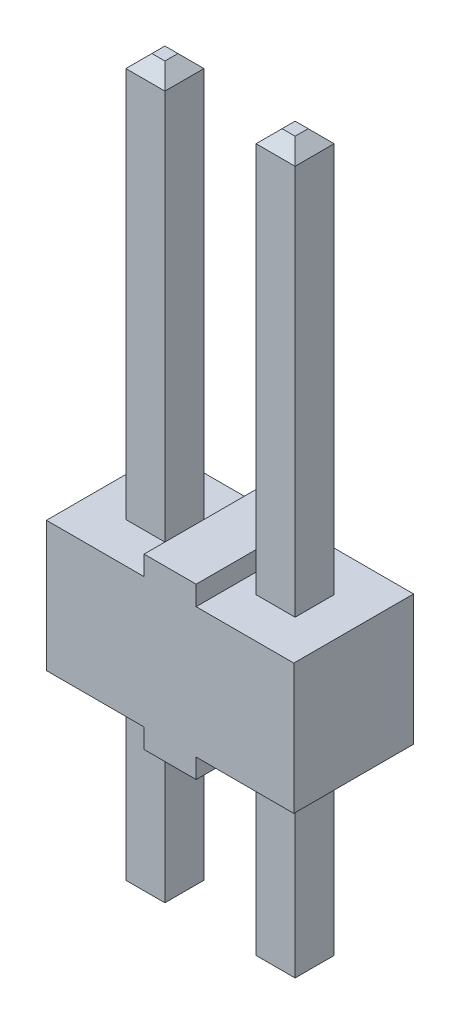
ISO-10303-21;
HEADER;
FILE_DESCRIPTION(('STEP AP214'),'2;1');
FILE_NAME('part.step','',(''),(''),'','','');
FILE_SCHEMA(('AUTOMOTIVE_DESIGN { 1 0 10303 214 1 1 1 1 }'));
ENDSEC;
DATA;
#1=APPLICATION_CONTEXT('core data for automotive mechanical design processes');
#2=APPLICATION_PROTOCOL_DEFINITION('international standard','automotive_design',2000,#1);
#3=PRODUCT_CONTEXT('',#1,'mechanical');
#4=PRODUCT('Part','Part','',(#3));
#5=PRODUCT_RELATED_PRODUCT_CATEGORY('part','',(#4));
#6=PRODUCT_DEFINITION_FORMATION('','',#4);
#7=PRODUCT_DEFINITION_CONTEXT('part definition',#1,'design');
#8=PRODUCT_DEFINITION('design','',#6,#7);
#9=PRODUCT_DEFINITION_SHAPE('','',#8);
#10=(LENGTH_UNIT() NAMED_UNIT(*) SI_UNIT(.MILLI.,.METRE.));
#11=(NAMED_UNIT(*) PLANE_ANGLE_UNIT() SI_UNIT($,.RADIAN.));
#12=(NAMED_UNIT(*) SI_UNIT($,.STERADIAN.) SOLID_ANGLE_UNIT());
#13=UNCERTAINTY_MEASURE_WITH_UNIT(LENGTH_MEASURE(1.E-05),#10,'distance_accuracy_value','');
#14=(GEOMETRIC_REPRESENTATION_CONTEXT(3) GLOBAL_UNCERTAINTY_ASSIGNED_CONTEXT((#13)) GLOBAL_UNIT_ASSIGNED_CONTEXT((#10,
#11,#12)) REPRESENTATION_CONTEXT('',''));
#15=CARTESIAN_POINT('',(0.,0.,0.));
#16=DIRECTION('',(0.,0.,1.));
#17=DIRECTION('',(1.,0.,0.));
#18=AXIS2_PLACEMENT_3D('',#15,#16,#17);
#19=CARTESIAN_POINT('',(0.889,8.89,0.381));
#20=DIRECTION('',(0.,0.707106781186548,0.707106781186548));
#21=DIRECTION('',(0.,-0.707106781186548,0.707106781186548));
#22=AXIS2_PLACEMENT_3D('',#19,#20,#21);
#23=PLANE('',#22);
#24=DIRECTION('',(1.,0.,0.));
#25=VECTOR('',#24,1.);
#26=CARTESIAN_POINT('',(0.889,9.144,0.127));
#27=LINE('',#26,#25);
#28=CARTESIAN_POINT('',(1.397,9.144,0.127));
#29=VERTEX_POINT('',#28);
#30=CARTESIAN_POINT('',(1.143,9.144,0.127));
#31=VERTEX_POINT('',#30);
#32=EDGE_CURVE('E21',#29,#31,#27,.F.);
#33=ORIENTED_EDGE('',*,*,#32,.T.);
#34=DIRECTION('',(-0.577350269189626,-0.577350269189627,0.577350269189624));
#35=VECTOR('',#34,1.);
#36=CARTESIAN_POINT('',(1.14300000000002,9.14400000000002,0.126999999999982));
#37=LINE('',#36,#35);
#38=CARTESIAN_POINT('',(0.889,8.89,0.381));
#39=VERTEX_POINT('',#38);
#40=EDGE_CURVE('E269',#31,#39,#37,.T.);
#41=ORIENTED_EDGE('',*,*,#40,.T.);
#42=DIRECTION('',(1.,0.,0.));
#43=VECTOR('',#42,1.);
#44=CARTESIAN_POINT('',(0.889,8.89,0.381));
#45=LINE('',#44,#43);
#46=CARTESIAN_POINT('',(1.651,8.89,0.381));
#47=VERTEX_POINT('',#46);
#48=EDGE_CURVE('E252',#39,#47,#45,.T.);
#49=ORIENTED_EDGE('',*,*,#48,.T.);
#50=DIRECTION('',(-0.577350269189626,0.577350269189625,-0.577350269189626));
#51=VECTOR('',#50,1.);
#52=CARTESIAN_POINT('',(1.651,8.89,0.381));
#53=LINE('',#52,#51);
#54=EDGE_CURVE('E250',#47,#29,#53,.T.);
#55=ORIENTED_EDGE('',*,*,#54,.T.);
#56=EDGE_LOOP('',(#33,#41,#49,#55));
#57=FACE_BOUND('',#56,.T.);
#58=ADVANCED_FACE('F18',(#57),#23,.T.);
#59=CARTESIAN_POINT('',(-1.651,8.89,0.381));
#60=DIRECTION('',(0.,0.707106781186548,0.707106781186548));
#61=DIRECTION('',(0.,-0.707106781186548,0.707106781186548));
#62=AXIS2_PLACEMENT_3D('',#59,#60,#61);
#63=PLANE('',#62);
#64=DIRECTION('',(1.,0.,0.));
#65=VECTOR('',#64,1.);
#66=CARTESIAN_POINT('',(-1.651,9.144,0.127));
#67=LINE('',#66,#65);
#68=CARTESIAN_POINT('',(-1.143,9.144,0.127));
#69=VERTEX_POINT('',#68);
#70=CARTESIAN_POINT('',(-1.397,9.144,0.127));
#71=VERTEX_POINT('',#70);
#72=EDGE_CURVE('E276',#69,#71,#67,.F.);
#73=ORIENTED_EDGE('',*,*,#72,.T.);
#74=DIRECTION('',(-0.577350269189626,-0.577350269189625,0.577350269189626));
#75=VECTOR('',#74,1.);
#76=CARTESIAN_POINT('',(-1.39699999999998,9.14400000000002,0.126999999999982));
#77=LINE('',#76,#75);
#78=CARTESIAN_POINT('',(-1.651,8.89,0.381));
#79=VERTEX_POINT('',#78);
#80=EDGE_CURVE('E285',#71,#79,#77,.T.);
#81=ORIENTED_EDGE('',*,*,#80,.T.);
#82=DIRECTION('',(1.,0.,0.));
#83=VECTOR('',#82,1.);
#84=CARTESIAN_POINT('',(-1.651,8.89,0.381));
#85=LINE('',#84,#83);
#86=CARTESIAN_POINT('',(-0.889,8.89,0.381));
#87=VERTEX_POINT('',#86);
#88=EDGE_CURVE('E289',#79,#87,#85,.T.);
#89=ORIENTED_EDGE('',*,*,#88,.T.);
#90=DIRECTION('',(-0.577350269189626,0.577350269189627,-0.577350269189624));
#91=VECTOR('',#90,1.);
#92=CARTESIAN_POINT('',(-0.889,8.89,0.381));
#93=LINE('',#92,#91);
#94=EDGE_CURVE('E278',#87,#69,#93,.T.);
#95=ORIENTED_EDGE('',*,*,#94,.T.);
#96=EDGE_LOOP('',(#73,#81,#89,#95));
#97=FACE_BOUND('',#96,.T.);
#98=ADVANCED_FACE('F748',(#97),#63,.T.);
#99=CARTESIAN_POINT('',(-1.651,-4.826,-0.381));
#100=DIRECTION('',(0.,-0.707106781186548,-0.707106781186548));
#101=DIRECTION('',(0.,0.707106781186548,-0.707106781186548));
#102=AXIS2_PLACEMENT_3D('',#99,#100,#101);
#103=PLANE('',#102);
#104=DIRECTION('',(1.,0.,0.));
#105=VECTOR('',#104,1.);
#106=CARTESIAN_POINT('',(-1.651,-5.08,-0.127));
#107=LINE('',#106,#105);
#108=CARTESIAN_POINT('',(-1.143,-5.08,-0.127));
#109=VERTEX_POINT('',#108);
#110=CARTESIAN_POINT('',(-1.397,-5.08,-0.127));
#111=VERTEX_POINT('',#110);
#112=EDGE_CURVE('E291',#109,#111,#107,.F.);
#113=ORIENTED_EDGE('',*,*,#112,.T.);
#114=DIRECTION('',(-0.577350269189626,0.577350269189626,-0.577350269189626));
#115=VECTOR('',#114,1.);
#116=CARTESIAN_POINT('',(-1.39699999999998,-5.08000000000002,-0.126999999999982));
#117=LINE('',#116,#115);
#118=CARTESIAN_POINT('',(-1.651,-4.826,-0.381));
#119=VERTEX_POINT('',#118);
#120=EDGE_CURVE('E300',#111,#119,#117,.T.);
#121=ORIENTED_EDGE('',*,*,#120,.T.);
#122=DIRECTION('',(-1.,0.,0.));
#123=VECTOR('',#122,1.);
#124=CARTESIAN_POINT('',(-1.651,-4.826,-0.381));
#125=LINE('',#124,#123);
#126=CARTESIAN_POINT('',(-0.889,-4.826,-0.381));
#127=VERTEX_POINT('',#126);
#128=EDGE_CURVE('E304',#119,#127,#125,.F.);
#129=ORIENTED_EDGE('',*,*,#128,.T.);
#130=DIRECTION('',(-0.577350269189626,-0.577350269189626,0.577350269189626));
#131=VECTOR('',#130,1.);
#132=CARTESIAN_POINT('',(-0.889,-4.826,-0.381));
#133=LINE('',#132,#131);
#134=EDGE_CURVE('E293',#127,#109,#133,.T.);
#135=ORIENTED_EDGE('',*,*,#134,.T.);
#136=EDGE_LOOP('',(#113,#121,#129,#135));
#137=FACE_BOUND('',#136,.T.);
#138=ADVANCED_FACE('F746',(#137),#103,.T.);
#139=CARTESIAN_POINT('',(0.889,-4.826,-0.381));
#140=DIRECTION('',(0.,-0.707106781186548,-0.707106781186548));
#141=DIRECTION('',(0.,0.707106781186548,-0.707106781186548));
#142=AXIS2_PLACEMENT_3D('',#139,#140,#141);
#143=PLANE('',#142);
#144=DIRECTION('',(1.,0.,0.));
#145=VECTOR('',#144,1.);
#146=CARTESIAN_POINT('',(0.889,-5.08,-0.127));
#147=LINE('',#146,#145);
#148=CARTESIAN_POINT('',(1.397,-5.08,-0.127));
#149=VERTEX_POINT('',#148);
#150=CARTESIAN_POINT('',(1.143,-5.08,-0.127));
#151=VERTEX_POINT('',#150);
#152=EDGE_CURVE('E306',#149,#151,#147,.F.);
#153=ORIENTED_EDGE('',*,*,#152,.T.);
#154=DIRECTION('',(-0.577350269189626,0.577350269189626,-0.577350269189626));
#155=VECTOR('',#154,1.);
#156=CARTESIAN_POINT('',(1.14300000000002,-5.08000000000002,-0.126999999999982));
#157=LINE('',#156,#155);
#158=CARTESIAN_POINT('',(0.889,-4.826,-0.381));
#159=VERTEX_POINT('',#158);
#160=EDGE_CURVE('E315',#151,#159,#157,.T.);
#161=ORIENTED_EDGE('',*,*,#160,.T.);
#162=DIRECTION('',(-1.,0.,0.));
#163=VECTOR('',#162,1.);
#164=CARTESIAN_POINT('',(0.889,-4.826,-0.381));
#165=LINE('',#164,#163);
#166=CARTESIAN_POINT('',(1.651,-4.826,-0.381));
#167=VERTEX_POINT('',#166);
#168=EDGE_CURVE('E319',#159,#167,#165,.F.);
#169=ORIENTED_EDGE('',*,*,#168,.T.);
#170=DIRECTION('',(-0.577350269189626,-0.577350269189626,0.577350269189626));
#171=VECTOR('',#170,1.);
#172=CARTESIAN_POINT('',(1.651,-4.826,-0.381));
#173=LINE('',#172,#171);
#174=EDGE_CURVE('E308',#167,#149,#173,.T.);
#175=ORIENTED_EDGE('',*,*,#174,.T.);
#176=EDGE_LOOP('',(#153,#161,#169,#175));
#177=FACE_BOUND('',#176,.T.);
#178=ADVANCED_FACE('F680',(#177),#143,.T.);
#179=CARTESIAN_POINT('',(0.889,9.144,-0.381));
#180=DIRECTION('',(0.,1.,0.));
#181=DIRECTION('',(0.,0.,1.));
#182=AXIS2_PLACEMENT_3D('',#179,#180,#181);
#183=PLANE('',#182);
#184=DIRECTION('',(0.,0.,1.));
#185=VECTOR('',#184,1.);
#186=CARTESIAN_POINT('',(1.397,9.144,-0.381));
#187=LINE('',#186,#185);
#188=CARTESIAN_POINT('',(1.397,9.144,-0.127));
#189=VERTEX_POINT('',#188);
#190=EDGE_CURVE('E257',#29,#189,#187,.F.);
#191=ORIENTED_EDGE('',*,*,#190,.T.);
#192=DIRECTION('',(1.,0.,0.));
#193=VECTOR('',#192,1.);
#194=CARTESIAN_POINT('',(0.889,9.144,-0.127));
#195=LINE('',#194,#193);
#196=CARTESIAN_POINT('',(1.143,9.144,-0.127));
#197=VERTEX_POINT('',#196);
#198=EDGE_CURVE('E327',#189,#197,#195,.F.);
#199=ORIENTED_EDGE('',*,*,#198,.T.);
#200=DIRECTION('',(0.,0.,1.));
#201=VECTOR('',#200,1.);
#202=CARTESIAN_POINT('',(1.143,9.144,-0.381));
#203=LINE('',#202,#201);
#204=EDGE_CURVE('E262',#197,#31,#203,.T.);
#205=ORIENTED_EDGE('',*,*,#204,.T.);
#206=ORIENTED_EDGE('',*,*,#32,.F.);
#207=EDGE_LOOP('',(#191,#199,#205,#206));
#208=FACE_BOUND('',#207,.T.);
#209=ADVANCED_FACE('F259',(#208),#183,.T.);
#210=CARTESIAN_POINT('',(1.651,8.89,-0.381));
#211=DIRECTION('',(-0.707106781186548,-0.707106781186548,0.));
#212=DIRECTION('',(0.707106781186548,-0.707106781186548,0.));
#213=AXIS2_PLACEMENT_3D('',#210,#211,#212);
#214=PLANE('',#213);
#215=ORIENTED_EDGE('',*,*,#190,.F.);
#216=ORIENTED_EDGE('',*,*,#54,.F.);
#217=DIRECTION('',(0.,0.,-1.));
#218=VECTOR('',#217,1.);
#219=CARTESIAN_POINT('',(1.651,8.89,0.));
#220=LINE('',#219,#218);
#221=CARTESIAN_POINT('',(1.651,8.89,-0.381));
#222=VERTEX_POINT('',#221);
#223=EDGE_CURVE('E325',#47,#222,#220,.T.);
#224=ORIENTED_EDGE('',*,*,#223,.T.);
#225=DIRECTION('',(-0.577350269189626,0.577350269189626,0.577350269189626));
#226=VECTOR('',#225,1.);
#227=CARTESIAN_POINT('',(1.65100000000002,8.88999999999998,-0.381000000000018));
#228=LINE('',#227,#226);
#229=EDGE_CURVE('E266',#222,#189,#228,.T.);
#230=ORIENTED_EDGE('',*,*,#229,.T.);
#231=EDGE_LOOP('',(#215,#216,#224,#230));
#232=FACE_BOUND('',#231,.T.);
#233=ADVANCED_FACE('F264',(#232),#214,.F.);
#234=CARTESIAN_POINT('',(0.889,8.89,-0.381));
#235=DIRECTION('',(-0.707106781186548,0.707106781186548,0.));
#236=DIRECTION('',(-0.707106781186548,-0.707106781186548,0.));
#237=AXIS2_PLACEMENT_3D('',#234,#235,#236);
#238=PLANE('',#237);
#239=ORIENTED_EDGE('',*,*,#204,.F.);
#240=DIRECTION('',(-0.577350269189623,-0.577350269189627,-0.577350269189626));
#241=VECTOR('',#240,1.);
#242=CARTESIAN_POINT('',(1.14300000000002,9.14400000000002,-0.126999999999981));
#243=LINE('',#242,#241);
#244=CARTESIAN_POINT('',(0.889,8.89,-0.381));
#245=VERTEX_POINT('',#244);
#246=EDGE_CURVE('E329',#197,#245,#243,.T.);
#247=ORIENTED_EDGE('',*,*,#246,.T.);
#248=DIRECTION('',(0.,0.,-1.));
#249=VECTOR('',#248,1.);
#250=CARTESIAN_POINT('',(0.889,8.89,0.));
#251=LINE('',#250,#249);
#252=EDGE_CURVE('E334',#245,#39,#251,.F.);
#253=ORIENTED_EDGE('',*,*,#252,.T.);
#254=ORIENTED_EDGE('',*,*,#40,.F.);
#255=EDGE_LOOP('',(#239,#247,#253,#254));
#256=FACE_BOUND('',#255,.T.);
#257=ADVANCED_FACE('F735',(#256),#238,.T.);
#258=CARTESIAN_POINT('',(0.889,9.144,0.381));
#259=DIRECTION('',(0.,0.,1.));
#260=DIRECTION('',(1.,0.,0.));
#261=AXIS2_PLACEMENT_3D('',#258,#259,#260);
#262=PLANE('',#261);
#263=ORIENTED_EDGE('',*,*,#48,.F.);
#264=DIRECTION('',(0.,1.,0.));
#265=VECTOR('',#264,1.);
#266=CARTESIAN_POINT('',(0.889,0.,0.381));
#267=LINE('',#266,#265);
#268=CARTESIAN_POINT('',(0.889,1.27,0.381));
#269=VERTEX_POINT('',#268);
#270=EDGE_CURVE('E337',#39,#269,#267,.F.);
#271=ORIENTED_EDGE('',*,*,#270,.T.);
#272=DIRECTION('',(1.,0.,0.));
#273=VECTOR('',#272,1.);
#274=CARTESIAN_POINT('',(0.889,1.27,0.381));
#275=LINE('',#274,#273);
#276=CARTESIAN_POINT('',(1.651,1.27,0.381));
#277=VERTEX_POINT('',#276);
#278=EDGE_CURVE('E273',#277,#269,#275,.F.);
#279=ORIENTED_EDGE('',*,*,#278,.F.);
#280=DIRECTION('',(0.,1.,0.));
#281=VECTOR('',#280,1.);
#282=CARTESIAN_POINT('',(1.651,0.,0.381));
#283=LINE('',#282,#281);
#284=EDGE_CURVE('E323',#277,#47,#283,.T.);
#285=ORIENTED_EDGE('',*,*,#284,.T.);
#286=EDGE_LOOP('',(#263,#271,#279,#285));
#287=FACE_BOUND('',#286,.T.);
#288=ADVANCED_FACE('F731',(#287),#262,.T.);
#289=CARTESIAN_POINT('',(-1.651,9.144,-0.381));
#290=DIRECTION('',(0.,1.,0.));
#291=DIRECTION('',(0.,0.,1.));
#292=AXIS2_PLACEMENT_3D('',#289,#290,#291);
#293=PLANE('',#292);
#294=DIRECTION('',(0.,0.,1.));
#295=VECTOR('',#294,1.);
#296=CARTESIAN_POINT('',(-1.143,9.144,-0.381));
#297=LINE('',#296,#295);
#298=CARTESIAN_POINT('',(-1.143,9.144,-0.127));
#299=VERTEX_POINT('',#298);
#300=EDGE_CURVE('E280',#69,#299,#297,.F.);
#301=ORIENTED_EDGE('',*,*,#300,.T.);
#302=DIRECTION('',(1.,0.,0.));
#303=VECTOR('',#302,1.);
#304=CARTESIAN_POINT('',(-1.651,9.144,-0.127));
#305=LINE('',#304,#303);
#306=CARTESIAN_POINT('',(-1.397,9.144,-0.127));
#307=VERTEX_POINT('',#306);
#308=EDGE_CURVE('E351',#299,#307,#305,.F.);
#309=ORIENTED_EDGE('',*,*,#308,.T.);
#310=DIRECTION('',(0.,0.,1.));
#311=VECTOR('',#310,1.);
#312=CARTESIAN_POINT('',(-1.397,9.144,-0.381));
#313=LINE('',#312,#311);
#314=EDGE_CURVE('E282',#307,#71,#313,.T.);
#315=ORIENTED_EDGE('',*,*,#314,.T.);
#316=ORIENTED_EDGE('',*,*,#72,.F.);
#317=EDGE_LOOP('',(#301,#309,#315,#316));
#318=FACE_BOUND('',#317,.T.);
#319=ADVANCED_FACE('F727',(#318),#293,.T.);
#320=CARTESIAN_POINT('',(-0.889,8.89,-0.381));
#321=DIRECTION('',(-0.707106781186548,-0.707106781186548,0.));
#322=DIRECTION('',(0.707106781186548,-0.707106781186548,0.));
#323=AXIS2_PLACEMENT_3D('',#320,#321,#322);
#324=PLANE('',#323);
#325=ORIENTED_EDGE('',*,*,#300,.F.);
#326=ORIENTED_EDGE('',*,*,#94,.F.);
#327=DIRECTION('',(0.,0.,-1.));
#328=VECTOR('',#327,1.);
#329=CARTESIAN_POINT('',(-0.889,8.89,0.));
#330=LINE('',#329,#328);
#331=CARTESIAN_POINT('',(-0.889,8.89,-0.381));
#332=VERTEX_POINT('',#331);
#333=EDGE_CURVE('E349',#87,#332,#330,.T.);
#334=ORIENTED_EDGE('',*,*,#333,.T.);
#335=DIRECTION('',(-0.577350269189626,0.577350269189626,0.577350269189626));
#336=VECTOR('',#335,1.);
#337=CARTESIAN_POINT('',(-0.888999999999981,8.88999999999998,-0.381000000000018));
#338=LINE('',#337,#336);
#339=EDGE_CURVE('E355',#332,#299,#338,.T.);
#340=ORIENTED_EDGE('',*,*,#339,.T.);
#341=EDGE_LOOP('',(#325,#326,#334,#340));
#342=FACE_BOUND('',#341,.T.);
#343=ADVANCED_FACE('F723',(#342),#324,.F.);
#344=CARTESIAN_POINT('',(-1.651,8.89,-0.381));
#345=DIRECTION('',(-0.707106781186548,0.707106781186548,0.));
#346=DIRECTION('',(-0.707106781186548,-0.707106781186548,0.));
#347=AXIS2_PLACEMENT_3D('',#344,#345,#346);
#348=PLANE('',#347);
#349=ORIENTED_EDGE('',*,*,#314,.F.);
#350=DIRECTION('',(-0.577350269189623,-0.577350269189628,-0.577350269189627));
#351=VECTOR('',#350,1.);
#352=CARTESIAN_POINT('',(-1.39699999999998,9.14400000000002,-0.126999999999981));
#353=LINE('',#352,#351);
#354=CARTESIAN_POINT('',(-1.651,8.89,-0.381));
#355=VERTEX_POINT('',#354);
#356=EDGE_CURVE('E353',#307,#355,#353,.T.);
#357=ORIENTED_EDGE('',*,*,#356,.T.);
#358=DIRECTION('',(0.,0.,-1.));
#359=VECTOR('',#358,1.);
#360=CARTESIAN_POINT('',(-1.651,8.89,0.));
#361=LINE('',#360,#359);
#362=EDGE_CURVE('E360',#355,#79,#361,.F.);
#363=ORIENTED_EDGE('',*,*,#362,.T.);
#364=ORIENTED_EDGE('',*,*,#80,.F.);
#365=EDGE_LOOP('',(#349,#357,#363,#364));
#366=FACE_BOUND('',#365,.T.);
#367=ADVANCED_FACE('F719',(#366),#348,.T.);
#368=CARTESIAN_POINT('',(-1.651,9.144,0.381));
#369=DIRECTION('',(0.,0.,1.));
#370=DIRECTION('',(1.,0.,0.));
#371=AXIS2_PLACEMENT_3D('',#368,#369,#370);
#372=PLANE('',#371);
#373=ORIENTED_EDGE('',*,*,#88,.F.);
#374=DIRECTION('',(0.,1.,0.));
#375=VECTOR('',#374,1.);
#376=CARTESIAN_POINT('',(-1.651,0.,0.381));
#377=LINE('',#376,#375);
#378=CARTESIAN_POINT('',(-1.651,1.27,0.381));
#379=VERTEX_POINT('',#378);
#380=EDGE_CURVE('E363',#79,#379,#377,.F.);
#381=ORIENTED_EDGE('',*,*,#380,.T.);
#382=DIRECTION('',(1.,0.,0.));
#383=VECTOR('',#382,1.);
#384=CARTESIAN_POINT('',(-1.651,1.27,0.381));
#385=LINE('',#384,#383);
#386=CARTESIAN_POINT('',(-0.889,1.27,0.381));
#387=VERTEX_POINT('',#386);
#388=EDGE_CURVE('E287',#387,#379,#385,.F.);
#389=ORIENTED_EDGE('',*,*,#388,.F.);
#390=DIRECTION('',(0.,1.,0.));
#391=VECTOR('',#390,1.);
#392=CARTESIAN_POINT('',(-0.889,0.,0.381));
#393=LINE('',#392,#391);
#394=EDGE_CURVE('E346',#387,#87,#393,.T.);
#395=ORIENTED_EDGE('',*,*,#394,.T.);
#396=EDGE_LOOP('',(#373,#381,#389,#395));
#397=FACE_BOUND('',#396,.T.);
#398=ADVANCED_FACE('F715',(#397),#372,.T.);
#399=CARTESIAN_POINT('',(-1.651,-5.08,0.381));
#400=DIRECTION('',(0.,-1.,0.));
#401=DIRECTION('',(0.,0.,-1.));
#402=AXIS2_PLACEMENT_3D('',#399,#400,#401);
#403=PLANE('',#402);
#404=DIRECTION('',(0.,0.,1.));
#405=VECTOR('',#404,1.);
#406=CARTESIAN_POINT('',(-1.143,-5.08,0.381));
#407=LINE('',#406,#405);
#408=CARTESIAN_POINT('',(-1.143,-5.08,0.127));
#409=VERTEX_POINT('',#408);
#410=EDGE_CURVE('E295',#109,#409,#407,.T.);
#411=ORIENTED_EDGE('',*,*,#410,.T.);
#412=DIRECTION('',(1.,0.,0.));
#413=VECTOR('',#412,1.);
#414=CARTESIAN_POINT('',(-1.651,-5.08,0.127));
#415=LINE('',#414,#413);
#416=CARTESIAN_POINT('',(-1.397,-5.08,0.127));
#417=VERTEX_POINT('',#416);
#418=EDGE_CURVE('E373',#409,#417,#415,.F.);
#419=ORIENTED_EDGE('',*,*,#418,.T.);
#420=DIRECTION('',(0.,0.,1.));
#421=VECTOR('',#420,1.);
#422=CARTESIAN_POINT('',(-1.397,-5.08,0.381));
#423=LINE('',#422,#421);
#424=EDGE_CURVE('E297',#417,#111,#423,.F.);
#425=ORIENTED_EDGE('',*,*,#424,.T.);
#426=ORIENTED_EDGE('',*,*,#112,.F.);
#427=EDGE_LOOP('',(#411,#419,#425,#426));
#428=FACE_BOUND('',#427,.T.);
#429=ADVANCED_FACE('F711',(#428),#403,.T.);
#430=CARTESIAN_POINT('',(-0.889,-4.826,0.381));
#431=DIRECTION('',(-0.707106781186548,0.707106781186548,0.));
#432=DIRECTION('',(-0.707106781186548,-0.707106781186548,0.));
#433=AXIS2_PLACEMENT_3D('',#430,#431,#432);
#434=PLANE('',#433);
#435=ORIENTED_EDGE('',*,*,#410,.F.);
#436=ORIENTED_EDGE('',*,*,#134,.F.);
#437=DIRECTION('',(0.,0.,-1.));
#438=VECTOR('',#437,1.);
#439=CARTESIAN_POINT('',(-0.889,-4.826,0.));
#440=LINE('',#439,#438);
#441=CARTESIAN_POINT('',(-0.889,-4.826,0.381));
#442=VERTEX_POINT('',#441);
#443=EDGE_CURVE('E371',#127,#442,#440,.F.);
#444=ORIENTED_EDGE('',*,*,#443,.T.);
#445=DIRECTION('',(-0.577350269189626,-0.577350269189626,-0.577350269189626));
#446=VECTOR('',#445,1.);
#447=CARTESIAN_POINT('',(-0.888999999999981,-4.82599999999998,0.381000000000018));
#448=LINE('',#447,#446);
#449=EDGE_CURVE('E377',#442,#409,#448,.T.);
#450=ORIENTED_EDGE('',*,*,#449,.T.);
#451=EDGE_LOOP('',(#435,#436,#444,#450));
#452=FACE_BOUND('',#451,.T.);
#453=ADVANCED_FACE('F707',(#452),#434,.F.);
#454=CARTESIAN_POINT('',(-1.651,-4.826,0.381));
#455=DIRECTION('',(-0.707106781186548,-0.707106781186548,0.));
#456=DIRECTION('',(0.707106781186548,-0.707106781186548,0.));
#457=AXIS2_PLACEMENT_3D('',#454,#455,#456);
#458=PLANE('',#457);
#459=ORIENTED_EDGE('',*,*,#424,.F.);
#460=DIRECTION('',(-0.577350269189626,0.577350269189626,0.577350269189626));
#461=VECTOR('',#460,1.);
#462=CARTESIAN_POINT('',(-1.39699999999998,-5.08000000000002,0.126999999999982));
#463=LINE('',#462,#461);
#464=CARTESIAN_POINT('',(-1.651,-4.826,0.381));
#465=VERTEX_POINT('',#464);
#466=EDGE_CURVE('E375',#417,#465,#463,.T.);
#467=ORIENTED_EDGE('',*,*,#466,.T.);
#468=DIRECTION('',(0.,0.,-1.));
#469=VECTOR('',#468,1.);
#470=CARTESIAN_POINT('',(-1.651,-4.826,0.));
#471=LINE('',#470,#469);
#472=EDGE_CURVE('E382',#465,#119,#471,.T.);
#473=ORIENTED_EDGE('',*,*,#472,.T.);
#474=ORIENTED_EDGE('',*,*,#120,.F.);
#475=EDGE_LOOP('',(#459,#467,#473,#474));
#476=FACE_BOUND('',#475,.T.);
#477=ADVANCED_FACE('F703',(#476),#458,.T.);
#478=CARTESIAN_POINT('',(-1.651,-5.08,-0.381));
#479=DIRECTION('',(0.,0.,-1.));
#480=DIRECTION('',(-1.,0.,0.));
#481=AXIS2_PLACEMENT_3D('',#478,#479,#480);
#482=PLANE('',#481);
#483=ORIENTED_EDGE('',*,*,#128,.F.);
#484=DIRECTION('',(0.,1.,0.));
#485=VECTOR('',#484,1.);
#486=CARTESIAN_POINT('',(-1.651,0.,-0.381));
#487=LINE('',#486,#485);
#488=CARTESIAN_POINT('',(-1.651,-1.27,-0.381));
#489=VERTEX_POINT('',#488);
#490=EDGE_CURVE('E385',#119,#489,#487,.T.);
#491=ORIENTED_EDGE('',*,*,#490,.T.);
#492=DIRECTION('',(-1.,0.,0.));
#493=VECTOR('',#492,1.);
#494=CARTESIAN_POINT('',(-1.651,-1.27,-0.381));
#495=LINE('',#494,#493);
#496=CARTESIAN_POINT('',(-0.889,-1.27,-0.381));
#497=VERTEX_POINT('',#496);
#498=EDGE_CURVE('E302',#497,#489,#495,.T.);
#499=ORIENTED_EDGE('',*,*,#498,.F.);
#500=DIRECTION('',(0.,1.,0.));
#501=VECTOR('',#500,1.);
#502=CARTESIAN_POINT('',(-0.889,0.,-0.381));
#503=LINE('',#502,#501);
#504=EDGE_CURVE('E368',#497,#127,#503,.F.);
#505=ORIENTED_EDGE('',*,*,#504,.T.);
#506=EDGE_LOOP('',(#483,#491,#499,#505));
#507=FACE_BOUND('',#506,.T.);
#508=ADVANCED_FACE('F697',(#507),#482,.T.);
#509=CARTESIAN_POINT('',(0.889,-5.08,0.381));
#510=DIRECTION('',(0.,-1.,0.));
#511=DIRECTION('',(0.,0.,-1.));
#512=AXIS2_PLACEMENT_3D('',#509,#510,#511);
#513=PLANE('',#512);
#514=DIRECTION('',(0.,0.,1.));
#515=VECTOR('',#514,1.);
#516=CARTESIAN_POINT('',(1.397,-5.08,0.381));
#517=LINE('',#516,#515);
#518=CARTESIAN_POINT('',(1.397,-5.08,0.127));
#519=VERTEX_POINT('',#518);
#520=EDGE_CURVE('E310',#149,#519,#517,.T.);
#521=ORIENTED_EDGE('',*,*,#520,.T.);
#522=DIRECTION('',(1.,0.,0.));
#523=VECTOR('',#522,1.);
#524=CARTESIAN_POINT('',(0.889,-5.08,0.127));
#525=LINE('',#524,#523);
#526=CARTESIAN_POINT('',(1.143,-5.08,0.127));
#527=VERTEX_POINT('',#526);
#528=EDGE_CURVE('E399',#519,#527,#525,.F.);
#529=ORIENTED_EDGE('',*,*,#528,.T.);
#530=DIRECTION('',(0.,0.,1.));
#531=VECTOR('',#530,1.);
#532=CARTESIAN_POINT('',(1.143,-5.08,0.381));
#533=LINE('',#532,#531);
#534=EDGE_CURVE('E312',#527,#151,#533,.F.);
#535=ORIENTED_EDGE('',*,*,#534,.T.);
#536=ORIENTED_EDGE('',*,*,#152,.F.);
#537=EDGE_LOOP('',(#521,#529,#535,#536));
#538=FACE_BOUND('',#537,.T.);
#539=ADVANCED_FACE('F685',(#538),#513,.T.);
#540=CARTESIAN_POINT('',(1.651,-4.826,0.381));
#541=DIRECTION('',(-0.707106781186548,0.707106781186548,0.));
#542=DIRECTION('',(-0.707106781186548,-0.707106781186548,0.));
#543=AXIS2_PLACEMENT_3D('',#540,#541,#542);
#544=PLANE('',#543);
#545=ORIENTED_EDGE('',*,*,#520,.F.);
#546=ORIENTED_EDGE('',*,*,#174,.F.);
#547=DIRECTION('',(0.,0.,-1.));
#548=VECTOR('',#547,1.);
#549=CARTESIAN_POINT('',(1.651,-4.826,0.));
#550=LINE('',#549,#548);
#551=CARTESIAN_POINT('',(1.651,-4.826,0.381));
#552=VERTEX_POINT('',#551);
#553=EDGE_CURVE('E397',#167,#552,#550,.F.);
#554=ORIENTED_EDGE('',*,*,#553,.T.);
#555=DIRECTION('',(-0.577350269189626,-0.577350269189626,-0.577350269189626));
#556=VECTOR('',#555,1.);
#557=CARTESIAN_POINT('',(1.65100000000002,-4.82599999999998,0.381000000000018));
#558=LINE('',#557,#556);
#559=EDGE_CURVE('E403',#552,#519,#558,.T.);
#560=ORIENTED_EDGE('',*,*,#559,.T.);
#561=EDGE_LOOP('',(#545,#546,#554,#560));
#562=FACE_BOUND('',#561,.T.);
#563=ADVANCED_FACE('F688',(#562),#544,.F.);
#564=CARTESIAN_POINT('',(0.889,-4.826,0.381));
#565=DIRECTION('',(-0.707106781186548,-0.707106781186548,0.));
#566=DIRECTION('',(0.707106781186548,-0.707106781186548,0.));
#567=AXIS2_PLACEMENT_3D('',#564,#565,#566);
#568=PLANE('',#567);
#569=ORIENTED_EDGE('',*,*,#534,.F.);
#570=DIRECTION('',(-0.577350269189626,0.577350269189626,0.577350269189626));
#571=VECTOR('',#570,1.);
#572=CARTESIAN_POINT('',(1.14300000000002,-5.08000000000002,0.126999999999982));
#573=LINE('',#572,#571);
#574=CARTESIAN_POINT('',(0.889,-4.826,0.381));
#575=VERTEX_POINT('',#574);
#576=EDGE_CURVE('E401',#527,#575,#573,.T.);
#577=ORIENTED_EDGE('',*,*,#576,.T.);
#578=DIRECTION('',(0.,0.,-1.));
#579=VECTOR('',#578,1.);
#580=CARTESIAN_POINT('',(0.889,-4.826,0.));
#581=LINE('',#580,#579);
#582=EDGE_CURVE('E408',#575,#159,#581,.T.);
#583=ORIENTED_EDGE('',*,*,#582,.T.);
#584=ORIENTED_EDGE('',*,*,#160,.F.);
#585=EDGE_LOOP('',(#569,#577,#583,#584));
#586=FACE_BOUND('',#585,.T.);
#587=ADVANCED_FACE('F683',(#586),#568,.T.);
#588=CARTESIAN_POINT('',(0.889,-5.08,-0.381));
#589=DIRECTION('',(0.,0.,-1.));
#590=DIRECTION('',(-1.,0.,0.));
#591=AXIS2_PLACEMENT_3D('',#588,#589,#590);
#592=PLANE('',#591);
#593=ORIENTED_EDGE('',*,*,#168,.F.);
#594=DIRECTION('',(0.,1.,0.));
#595=VECTOR('',#594,1.);
#596=CARTESIAN_POINT('',(0.889,0.,-0.381));
#597=LINE('',#596,#595);
#598=CARTESIAN_POINT('',(0.889,-1.27,-0.381));
#599=VERTEX_POINT('',#598);
#600=EDGE_CURVE('E411',#159,#599,#597,.T.);
#601=ORIENTED_EDGE('',*,*,#600,.T.);
#602=DIRECTION('',(-1.,0.,0.));
#603=VECTOR('',#602,1.);
#604=CARTESIAN_POINT('',(0.889,-1.27,-0.381));
#605=LINE('',#604,#603);
#606=CARTESIAN_POINT('',(1.651,-1.27,-0.381));
#607=VERTEX_POINT('',#606);
#608=EDGE_CURVE('E317',#607,#599,#605,.T.);
#609=ORIENTED_EDGE('',*,*,#608,.F.);
#610=DIRECTION('',(0.,1.,0.));
#611=VECTOR('',#610,1.);
#612=CARTESIAN_POINT('',(1.651,0.,-0.381));
#613=LINE('',#612,#611);
#614=EDGE_CURVE('E394',#607,#167,#613,.F.);
#615=ORIENTED_EDGE('',*,*,#614,.T.);
#616=EDGE_LOOP('',(#593,#601,#609,#615));
#617=FACE_BOUND('',#616,.T.);
#618=ADVANCED_FACE('F677',(#617),#592,.T.);
#619=CARTESIAN_POINT('',(1.651,0.,0.));
#620=DIRECTION('',(1.,0.,0.));
#621=DIRECTION('',(0.,0.,-1.));
#622=AXIS2_PLACEMENT_3D('',#619,#620,#621);
#623=PLANE('',#622);
#624=ORIENTED_EDGE('',*,*,#223,.F.);
#625=ORIENTED_EDGE('',*,*,#284,.F.);
#626=DIRECTION('',(0.,0.,-1.));
#627=VECTOR('',#626,1.);
#628=CARTESIAN_POINT('',(1.651,1.27,0.));
#629=LINE('',#628,#627);
#630=CARTESIAN_POINT('',(1.651,1.27,-0.381));
#631=VERTEX_POINT('',#630);
#632=EDGE_CURVE('E321',#631,#277,#629,.F.);
#633=ORIENTED_EDGE('',*,*,#632,.F.);
#634=DIRECTION('',(0.,1.,0.));
#635=VECTOR('',#634,1.);
#636=CARTESIAN_POINT('',(1.651,1.27,-0.381));
#637=LINE('',#636,#635);
#638=EDGE_CURVE('E419',#631,#222,#637,.T.);
#639=ORIENTED_EDGE('',*,*,#638,.T.);
#640=EDGE_LOOP('',(#624,#625,#633,#639));
#641=FACE_BOUND('',#640,.T.);
#642=ADVANCED_FACE('F799',(#641),#623,.T.);
#643=CARTESIAN_POINT('',(0.889,9.144,-0.127));
#644=DIRECTION('',(0.,0.707106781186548,-0.707106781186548));
#645=DIRECTION('',(0.,0.707106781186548,0.707106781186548));
#646=AXIS2_PLACEMENT_3D('',#643,#644,#645);
#647=PLANE('',#646);
#648=DIRECTION('',(-1.,0.,0.));
#649=VECTOR('',#648,1.);
#650=CARTESIAN_POINT('',(0.889,8.89,-0.381));
#651=LINE('',#650,#649);
#652=EDGE_CURVE('E422',#222,#245,#651,.T.);
#653=ORIENTED_EDGE('',*,*,#652,.T.);
#654=ORIENTED_EDGE('',*,*,#246,.F.);
#655=ORIENTED_EDGE('',*,*,#198,.F.);
#656=ORIENTED_EDGE('',*,*,#229,.F.);
#657=EDGE_LOOP('',(#653,#654,#655,#656));
#658=FACE_BOUND('',#657,.T.);
#659=ADVANCED_FACE('F795',(#658),#647,.T.);
#660=CARTESIAN_POINT('',(0.889,0.,0.));
#661=DIRECTION('',(1.,0.,0.));
#662=DIRECTION('',(0.,0.,-1.));
#663=AXIS2_PLACEMENT_3D('',#660,#661,#662);
#664=PLANE('',#663);
#665=ORIENTED_EDGE('',*,*,#252,.F.);
#666=DIRECTION('',(0.,1.,0.));
#667=VECTOR('',#666,1.);
#668=CARTESIAN_POINT('',(0.889,1.27,-0.381));
#669=LINE('',#668,#667);
#670=CARTESIAN_POINT('',(0.889,1.27,-0.381));
#671=VERTEX_POINT('',#670);
#672=EDGE_CURVE('E425',#245,#671,#669,.F.);
#673=ORIENTED_EDGE('',*,*,#672,.T.);
#674=DIRECTION('',(0.,0.,-1.));
#675=VECTOR('',#674,1.);
#676=CARTESIAN_POINT('',(0.889,1.27,0.));
#677=LINE('',#676,#675);
#678=EDGE_CURVE('E332',#269,#671,#677,.T.);
#679=ORIENTED_EDGE('',*,*,#678,.F.);
#680=ORIENTED_EDGE('',*,*,#270,.F.);
#681=EDGE_LOOP('',(#665,#673,#679,#680));
#682=FACE_BOUND('',#681,.T.);
#683=ADVANCED_FACE('F792',(#682),#664,.F.);
#684=CARTESIAN_POINT('',(-2.413,1.651,-1.1684));
#685=DIRECTION('',(0.,1.,0.));
#686=DIRECTION('',(0.,0.,1.));
#687=AXIS2_PLACEMENT_3D('',#684,#685,#686);
#688=PLANE('',#687);
#689=DIRECTION('',(0.,0.,1.));
#690=VECTOR('',#689,1.);
#691=CARTESIAN_POINT('',(0.508,1.651,1.1684));
#692=LINE('',#691,#690);
#693=CARTESIAN_POINT('',(0.508,1.651,1.1684));
#694=VERTEX_POINT('',#693);
#695=CARTESIAN_POINT('',(0.508,1.651,-1.1684));
#696=VERTEX_POINT('',#695);
#697=EDGE_CURVE('E414',#694,#696,#692,.F.);
#698=ORIENTED_EDGE('',*,*,#697,.T.);
#699=DIRECTION('',(1.,0.,0.));
#700=VECTOR('',#699,1.);
#701=CARTESIAN_POINT('',(-2.413,1.651,-1.1684));
#702=LINE('',#701,#700);
#703=CARTESIAN_POINT('',(-0.508,1.651,-1.1684));
#704=VERTEX_POINT('',#703);
#705=EDGE_CURVE('E340',#704,#696,#702,.T.);
#706=ORIENTED_EDGE('',*,*,#705,.F.);
#707=DIRECTION('',(0.,0.,-1.));
#708=VECTOR('',#707,1.);
#709=CARTESIAN_POINT('',(-0.508,1.651,1.1684));
#710=LINE('',#709,#708);
#711=CARTESIAN_POINT('',(-0.508,1.651,1.1684));
#712=VERTEX_POINT('',#711);
#713=EDGE_CURVE('E430',#704,#712,#710,.F.);
#714=ORIENTED_EDGE('',*,*,#713,.T.);
#715=DIRECTION('',(1.,0.,0.));
#716=VECTOR('',#715,1.);
#717=CARTESIAN_POINT('',(-2.413,1.651,1.1684));
#718=LINE('',#717,#716);
#719=EDGE_CURVE('E342',#694,#712,#718,.F.);
#720=ORIENTED_EDGE('',*,*,#719,.F.);
#721=EDGE_LOOP('',(#698,#706,#714,#720));
#722=FACE_BOUND('',#721,.T.);
#723=ADVANCED_FACE('F569',(#722),#688,.T.);
#724=CARTESIAN_POINT('',(-0.889,0.,0.));
#725=DIRECTION('',(1.,0.,0.));
#726=DIRECTION('',(0.,0.,-1.));
#727=AXIS2_PLACEMENT_3D('',#724,#725,#726);
#728=PLANE('',#727);
#729=ORIENTED_EDGE('',*,*,#333,.F.);
#730=ORIENTED_EDGE('',*,*,#394,.F.);
#731=DIRECTION('',(0.,0.,-1.));
#732=VECTOR('',#731,1.);
#733=CARTESIAN_POINT('',(-0.889,1.27,0.));
#734=LINE('',#733,#732);
#735=CARTESIAN_POINT('',(-0.889,1.27,-0.381));
#736=VERTEX_POINT('',#735);
#737=EDGE_CURVE('E344',#736,#387,#734,.F.);
#738=ORIENTED_EDGE('',*,*,#737,.F.);
#739=DIRECTION('',(0.,1.,0.));
#740=VECTOR('',#739,1.);
#741=CARTESIAN_POINT('',(-0.889,1.27,-0.381));
#742=LINE('',#741,#740);
#743=EDGE_CURVE('E433',#736,#332,#742,.T.);
#744=ORIENTED_EDGE('',*,*,#743,.T.);
#745=EDGE_LOOP('',(#729,#730,#738,#744));
#746=FACE_BOUND('',#745,.T.);
#747=ADVANCED_FACE('F773',(#746),#728,.T.);
#748=CARTESIAN_POINT('',(-1.651,9.144,-0.127));
#749=DIRECTION('',(0.,0.707106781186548,-0.707106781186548));
#750=DIRECTION('',(0.,0.707106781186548,0.707106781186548));
#751=AXIS2_PLACEMENT_3D('',#748,#749,#750);
#752=PLANE('',#751);
#753=DIRECTION('',(-1.,0.,0.));
#754=VECTOR('',#753,1.);
#755=CARTESIAN_POINT('',(-1.651,8.89,-0.381));
#756=LINE('',#755,#754);
#757=EDGE_CURVE('E436',#332,#355,#756,.T.);
#758=ORIENTED_EDGE('',*,*,#757,.T.);
#759=ORIENTED_EDGE('',*,*,#356,.F.);
#760=ORIENTED_EDGE('',*,*,#308,.F.);
#761=ORIENTED_EDGE('',*,*,#339,.F.);
#762=EDGE_LOOP('',(#758,#759,#760,#761));
#763=FACE_BOUND('',#762,.T.);
#764=ADVANCED_FACE('F778',(#763),#752,.T.);
#765=CARTESIAN_POINT('',(-1.651,0.,0.));
#766=DIRECTION('',(1.,0.,0.));
#767=DIRECTION('',(0.,0.,-1.));
#768=AXIS2_PLACEMENT_3D('',#765,#766,#767);
#769=PLANE('',#768);
#770=ORIENTED_EDGE('',*,*,#362,.F.);
#771=DIRECTION('',(0.,1.,0.));
#772=VECTOR('',#771,1.);
#773=CARTESIAN_POINT('',(-1.651,1.27,-0.381));
#774=LINE('',#773,#772);
#775=CARTESIAN_POINT('',(-1.651,1.27,-0.381));
#776=VERTEX_POINT('',#775);
#777=EDGE_CURVE('E439',#355,#776,#774,.F.);
#778=ORIENTED_EDGE('',*,*,#777,.T.);
#779=DIRECTION('',(0.,0.,-1.));
#780=VECTOR('',#779,1.);
#781=CARTESIAN_POINT('',(-1.651,1.27,0.));
#782=LINE('',#781,#780);
#783=EDGE_CURVE('E358',#379,#776,#782,.T.);
#784=ORIENTED_EDGE('',*,*,#783,.F.);
#785=ORIENTED_EDGE('',*,*,#380,.F.);
#786=EDGE_LOOP('',(#770,#778,#784,#785));
#787=FACE_BOUND('',#786,.T.);
#788=ADVANCED_FACE('F769',(#787),#769,.F.);
#789=CARTESIAN_POINT('',(-0.889,0.,0.));
#790=DIRECTION('',(1.,0.,0.));
#791=DIRECTION('',(0.,0.,-1.));
#792=AXIS2_PLACEMENT_3D('',#789,#790,#791);
#793=PLANE('',#792);
#794=ORIENTED_EDGE('',*,*,#443,.F.);
#795=ORIENTED_EDGE('',*,*,#504,.F.);
#796=DIRECTION('',(0.,0.,-1.));
#797=VECTOR('',#796,1.);
#798=CARTESIAN_POINT('',(-0.889,-1.27,0.));
#799=LINE('',#798,#797);
#800=CARTESIAN_POINT('',(-0.889,-1.27,0.381));
#801=VERTEX_POINT('',#800);
#802=EDGE_CURVE('E366',#801,#497,#799,.T.);
#803=ORIENTED_EDGE('',*,*,#802,.F.);
#804=DIRECTION('',(0.,1.,0.));
#805=VECTOR('',#804,1.);
#806=CARTESIAN_POINT('',(-0.889,-1.27,0.381));
#807=LINE('',#806,#805);
#808=EDGE_CURVE('E447',#801,#442,#807,.F.);
#809=ORIENTED_EDGE('',*,*,#808,.T.);
#810=EDGE_LOOP('',(#794,#795,#803,#809));
#811=FACE_BOUND('',#810,.T.);
#812=ADVANCED_FACE('F785',(#811),#793,.T.);
#813=CARTESIAN_POINT('',(-1.651,-5.08,0.127));
#814=DIRECTION('',(0.,-0.707106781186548,0.707106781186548));
#815=DIRECTION('',(0.,-0.707106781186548,-0.707106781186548));
#816=AXIS2_PLACEMENT_3D('',#813,#814,#815);
#817=PLANE('',#816);
#818=DIRECTION('',(1.,0.,0.));
#819=VECTOR('',#818,1.);
#820=CARTESIAN_POINT('',(-1.651,-4.826,0.381));
#821=LINE('',#820,#819);
#822=EDGE_CURVE('E450',#442,#465,#821,.F.);
#823=ORIENTED_EDGE('',*,*,#822,.T.);
#824=ORIENTED_EDGE('',*,*,#466,.F.);
#825=ORIENTED_EDGE('',*,*,#418,.F.);
#826=ORIENTED_EDGE('',*,*,#449,.F.);
#827=EDGE_LOOP('',(#823,#824,#825,#826));
#828=FACE_BOUND('',#827,.T.);
#829=ADVANCED_FACE('F603',(#828),#817,.T.);
#830=CARTESIAN_POINT('',(-1.651,0.,0.));
#831=DIRECTION('',(1.,0.,0.));
#832=DIRECTION('',(0.,0.,-1.));
#833=AXIS2_PLACEMENT_3D('',#830,#831,#832);
#834=PLANE('',#833);
#835=ORIENTED_EDGE('',*,*,#472,.F.);
#836=DIRECTION('',(0.,1.,0.));
#837=VECTOR('',#836,1.);
#838=CARTESIAN_POINT('',(-1.651,-1.27,0.381));
#839=LINE('',#838,#837);
#840=CARTESIAN_POINT('',(-1.651,-1.27,0.381));
#841=VERTEX_POINT('',#840);
#842=EDGE_CURVE('E453',#465,#841,#839,.T.);
#843=ORIENTED_EDGE('',*,*,#842,.T.);
#844=DIRECTION('',(0.,0.,-1.));
#845=VECTOR('',#844,1.);
#846=CARTESIAN_POINT('',(-1.651,-1.27,0.));
#847=LINE('',#846,#845);
#848=EDGE_CURVE('E380',#489,#841,#847,.F.);
#849=ORIENTED_EDGE('',*,*,#848,.F.);
#850=ORIENTED_EDGE('',*,*,#490,.F.);
#851=EDGE_LOOP('',(#835,#843,#849,#850));
#852=FACE_BOUND('',#851,.T.);
#853=ADVANCED_FACE('F594',(#852),#834,.F.);
#854=CARTESIAN_POINT('',(-2.413,-1.651,1.1684));
#855=DIRECTION('',(0.,-1.,0.));
#856=DIRECTION('',(0.,0.,-1.));
#857=AXIS2_PLACEMENT_3D('',#854,#855,#856);
#858=PLANE('',#857);
#859=DIRECTION('',(0.,0.,1.));
#860=VECTOR('',#859,1.);
#861=CARTESIAN_POINT('',(0.508,-1.651,1.1684));
#862=LINE('',#861,#860);
#863=CARTESIAN_POINT('',(0.508,-1.651,-1.1684));
#864=VERTEX_POINT('',#863);
#865=CARTESIAN_POINT('',(0.508,-1.651,1.1684));
#866=VERTEX_POINT('',#865);
#867=EDGE_CURVE('E458',#864,#866,#862,.T.);
#868=ORIENTED_EDGE('',*,*,#867,.T.);
#869=DIRECTION('',(1.,0.,0.));
#870=VECTOR('',#869,1.);
#871=CARTESIAN_POINT('',(-2.413,-1.651,1.1684));
#872=LINE('',#871,#870);
#873=CARTESIAN_POINT('',(-0.508,-1.651,1.1684));
#874=VERTEX_POINT('',#873);
#875=EDGE_CURVE('E388',#874,#866,#872,.T.);
#876=ORIENTED_EDGE('',*,*,#875,.F.);
#877=DIRECTION('',(0.,0.,-1.));
#878=VECTOR('',#877,1.);
#879=CARTESIAN_POINT('',(-0.508,-1.651,1.1684));
#880=LINE('',#879,#878);
#881=CARTESIAN_POINT('',(-0.508,-1.651,-1.1684));
#882=VERTEX_POINT('',#881);
#883=EDGE_CURVE('E442',#874,#882,#880,.T.);
#884=ORIENTED_EDGE('',*,*,#883,.T.);
#885=DIRECTION('',(1.,0.,0.));
#886=VECTOR('',#885,1.);
#887=CARTESIAN_POINT('',(-2.413,-1.651,-1.1684));
#888=LINE('',#887,#886);
#889=EDGE_CURVE('E390',#864,#882,#888,.F.);
#890=ORIENTED_EDGE('',*,*,#889,.F.);
#891=EDGE_LOOP('',(#868,#876,#884,#890));
#892=FACE_BOUND('',#891,.T.);
#893=ADVANCED_FACE('F591',(#892),#858,.T.);
#894=CARTESIAN_POINT('',(1.651,0.,0.));
#895=DIRECTION('',(1.,0.,0.));
#896=DIRECTION('',(0.,0.,-1.));
#897=AXIS2_PLACEMENT_3D('',#894,#895,#896);
#898=PLANE('',#897);
#899=ORIENTED_EDGE('',*,*,#553,.F.);
#900=ORIENTED_EDGE('',*,*,#614,.F.);
#901=DIRECTION('',(0.,0.,-1.));
#902=VECTOR('',#901,1.);
#903=CARTESIAN_POINT('',(1.651,-1.27,0.));
#904=LINE('',#903,#902);
#905=CARTESIAN_POINT('',(1.651,-1.27,0.381));
#906=VERTEX_POINT('',#905);
#907=EDGE_CURVE('E392',#906,#607,#904,.T.);
#908=ORIENTED_EDGE('',*,*,#907,.F.);
#909=DIRECTION('',(0.,1.,0.));
#910=VECTOR('',#909,1.);
#911=CARTESIAN_POINT('',(1.651,-1.27,0.381));
#912=LINE('',#911,#910);
#913=EDGE_CURVE('E461',#906,#552,#912,.F.);
#914=ORIENTED_EDGE('',*,*,#913,.T.);
#915=EDGE_LOOP('',(#899,#900,#908,#914));
#916=FACE_BOUND('',#915,.T.);
#917=ADVANCED_FACE('F593',(#916),#898,.T.);
#918=CARTESIAN_POINT('',(0.889,-5.08,0.127));
#919=DIRECTION('',(0.,-0.707106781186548,0.707106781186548));
#920=DIRECTION('',(0.,-0.707106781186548,-0.707106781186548));
#921=AXIS2_PLACEMENT_3D('',#918,#919,#920);
#922=PLANE('',#921);
#923=DIRECTION('',(1.,0.,0.));
#924=VECTOR('',#923,1.);
#925=CARTESIAN_POINT('',(0.889,-4.826,0.381));
#926=LINE('',#925,#924);
#927=EDGE_CURVE('E464',#552,#575,#926,.F.);
#928=ORIENTED_EDGE('',*,*,#927,.T.);
#929=ORIENTED_EDGE('',*,*,#576,.F.);
#930=ORIENTED_EDGE('',*,*,#528,.F.);
#931=ORIENTED_EDGE('',*,*,#559,.F.);
#932=EDGE_LOOP('',(#928,#929,#930,#931));
#933=FACE_BOUND('',#932,.T.);
#934=ADVANCED_FACE('F600',(#933),#922,.T.);
#935=CARTESIAN_POINT('',(0.889,0.,0.));
#936=DIRECTION('',(1.,0.,0.));
#937=DIRECTION('',(0.,0.,-1.));
#938=AXIS2_PLACEMENT_3D('',#935,#936,#937);
#939=PLANE('',#938);
#940=ORIENTED_EDGE('',*,*,#582,.F.);
#941=DIRECTION('',(0.,1.,0.));
#942=VECTOR('',#941,1.);
#943=CARTESIAN_POINT('',(0.889,-1.27,0.381));
#944=LINE('',#943,#942);
#945=CARTESIAN_POINT('',(0.889,-1.27,0.381));
#946=VERTEX_POINT('',#945);
#947=EDGE_CURVE('E467',#575,#946,#944,.T.);
#948=ORIENTED_EDGE('',*,*,#947,.T.);
#949=DIRECTION('',(0.,0.,-1.));
#950=VECTOR('',#949,1.);
#951=CARTESIAN_POINT('',(0.889,-1.27,0.));
#952=LINE('',#951,#950);
#953=EDGE_CURVE('E406',#599,#946,#952,.F.);
#954=ORIENTED_EDGE('',*,*,#953,.F.);
#955=ORIENTED_EDGE('',*,*,#600,.F.);
#956=EDGE_LOOP('',(#940,#948,#954,#955));
#957=FACE_BOUND('',#956,.T.);
#958=ADVANCED_FACE('F653',(#957),#939,.F.);
#959=CARTESIAN_POINT('',(0.508,1.651,1.1684));
#960=DIRECTION('',(-1.,0.,0.));
#961=DIRECTION('',(0.,0.,1.));
#962=AXIS2_PLACEMENT_3D('',#959,#960,#961);
#963=PLANE('',#962);
#964=DIRECTION('',(0.,1.,0.));
#965=VECTOR('',#964,1.);
#966=CARTESIAN_POINT('',(0.508,1.651,-1.1684));
#967=LINE('',#966,#965);
#968=CARTESIAN_POINT('',(0.508,1.27,-1.1684));
#969=VERTEX_POINT('',#968);
#970=EDGE_CURVE('E417',#696,#969,#967,.F.);
#971=ORIENTED_EDGE('',*,*,#970,.F.);
#972=ORIENTED_EDGE('',*,*,#697,.F.);
#973=DIRECTION('',(0.,1.,0.));
#974=VECTOR('',#973,1.);
#975=CARTESIAN_POINT('',(0.508,1.651,1.1684));
#976=LINE('',#975,#974);
#977=CARTESIAN_POINT('',(0.508,1.27,1.1684));
#978=VERTEX_POINT('',#977);
#979=EDGE_CURVE('E478',#694,#978,#976,.F.);
#980=ORIENTED_EDGE('',*,*,#979,.T.);
#981=DIRECTION('',(0.,0.,-1.));
#982=VECTOR('',#981,1.);
#983=CARTESIAN_POINT('',(0.508,1.27,1.1684));
#984=LINE('',#983,#982);
#985=EDGE_CURVE('E483',#978,#969,#984,.T.);
#986=ORIENTED_EDGE('',*,*,#985,.T.);
#987=EDGE_LOOP('',(#971,#972,#980,#986));
#988=FACE_BOUND('',#987,.T.);
#989=ADVANCED_FACE('F575',(#988),#963,.F.);
#990=CARTESIAN_POINT('',(0.889,1.27,-0.381));
#991=DIRECTION('',(0.,0.,-1.));
#992=DIRECTION('',(-1.,0.,0.));
#993=AXIS2_PLACEMENT_3D('',#990,#991,#992);
#994=PLANE('',#993);
#995=ORIENTED_EDGE('',*,*,#652,.F.);
#996=ORIENTED_EDGE('',*,*,#638,.F.);
#997=DIRECTION('',(1.,0.,0.));
#998=VECTOR('',#997,1.);
#999=CARTESIAN_POINT('',(0.508,1.27,-0.381));
#1000=LINE('',#999,#998);
#1001=EDGE_CURVE('E486',#631,#671,#1000,.F.);
#1002=ORIENTED_EDGE('',*,*,#1001,.T.);
#1003=ORIENTED_EDGE('',*,*,#672,.F.);
#1004=EDGE_LOOP('',(#995,#996,#1002,#1003));
#1005=FACE_BOUND('',#1004,.T.);
#1006=ADVANCED_FACE('F647',(#1005),#994,.T.);
#1007=CARTESIAN_POINT('',(-0.508,1.27,1.1684));
#1008=DIRECTION('',(1.,0.,0.));
#1009=DIRECTION('',(0.,0.,-1.));
#1010=AXIS2_PLACEMENT_3D('',#1007,#1008,#1009);
#1011=PLANE('',#1010);
#1012=DIRECTION('',(0.,1.,0.));
#1013=VECTOR('',#1012,1.);
#1014=CARTESIAN_POINT('',(-0.508,1.27,-1.1684));
#1015=LINE('',#1014,#1013);
#1016=CARTESIAN_POINT('',(-0.508,1.27,-1.1684));
#1017=VERTEX_POINT('',#1016);
#1018=EDGE_CURVE('E428',#1017,#704,#1015,.T.);
#1019=ORIENTED_EDGE('',*,*,#1018,.F.);
#1020=DIRECTION('',(0.,0.,-1.));
#1021=VECTOR('',#1020,1.);
#1022=CARTESIAN_POINT('',(-0.508,1.27,1.1684));
#1023=LINE('',#1022,#1021);
#1024=CARTESIAN_POINT('',(-0.508,1.27,1.1684));
#1025=VERTEX_POINT('',#1024);
#1026=EDGE_CURVE('E491',#1017,#1025,#1023,.F.);
#1027=ORIENTED_EDGE('',*,*,#1026,.T.);
#1028=DIRECTION('',(0.,1.,0.));
#1029=VECTOR('',#1028,1.);
#1030=CARTESIAN_POINT('',(-0.508,1.651,1.1684));
#1031=LINE('',#1030,#1029);
#1032=EDGE_CURVE('E475',#1025,#712,#1031,.T.);
#1033=ORIENTED_EDGE('',*,*,#1032,.T.);
#1034=ORIENTED_EDGE('',*,*,#713,.F.);
#1035=EDGE_LOOP('',(#1019,#1027,#1033,#1034));
#1036=FACE_BOUND('',#1035,.T.);
#1037=ADVANCED_FACE('F572',(#1036),#1011,.F.);
#1038=CARTESIAN_POINT('',(-1.651,1.27,-0.381));
#1039=DIRECTION('',(0.,0.,-1.));
#1040=DIRECTION('',(-1.,0.,0.));
#1041=AXIS2_PLACEMENT_3D('',#1038,#1039,#1040);
#1042=PLANE('',#1041);
#1043=ORIENTED_EDGE('',*,*,#757,.F.);
#1044=ORIENTED_EDGE('',*,*,#743,.F.);
#1045=DIRECTION('',(1.,0.,0.));
#1046=VECTOR('',#1045,1.);
#1047=CARTESIAN_POINT('',(-2.032,1.27,-0.381));
#1048=LINE('',#1047,#1046);
#1049=EDGE_CURVE('E494',#736,#776,#1048,.F.);
#1050=ORIENTED_EDGE('',*,*,#1049,.T.);
#1051=ORIENTED_EDGE('',*,*,#777,.F.);
#1052=EDGE_LOOP('',(#1043,#1044,#1050,#1051));
#1053=FACE_BOUND('',#1052,.T.);
#1054=ADVANCED_FACE('F641',(#1053),#1042,.T.);
#1055=CARTESIAN_POINT('',(-0.508,-1.651,1.1684));
#1056=DIRECTION('',(1.,0.,0.));
#1057=DIRECTION('',(0.,0.,-1.));
#1058=AXIS2_PLACEMENT_3D('',#1055,#1056,#1057);
#1059=PLANE('',#1058);
#1060=DIRECTION('',(0.,1.,0.));
#1061=VECTOR('',#1060,1.);
#1062=CARTESIAN_POINT('',(-0.508,-1.651,-1.1684));
#1063=LINE('',#1062,#1061);
#1064=CARTESIAN_POINT('',(-0.508,-1.27,-1.1684));
#1065=VERTEX_POINT('',#1064);
#1066=EDGE_CURVE('E445',#882,#1065,#1063,.T.);
#1067=ORIENTED_EDGE('',*,*,#1066,.F.);
#1068=ORIENTED_EDGE('',*,*,#883,.F.);
#1069=DIRECTION('',(0.,1.,0.));
#1070=VECTOR('',#1069,1.);
#1071=CARTESIAN_POINT('',(-0.508,1.651,1.1684));
#1072=LINE('',#1071,#1070);
#1073=CARTESIAN_POINT('',(-0.508,-1.27,1.1684));
#1074=VERTEX_POINT('',#1073);
#1075=EDGE_CURVE('E473',#874,#1074,#1072,.T.);
#1076=ORIENTED_EDGE('',*,*,#1075,.T.);
#1077=DIRECTION('',(0.,0.,1.));
#1078=VECTOR('',#1077,1.);
#1079=CARTESIAN_POINT('',(-0.508,-1.27,1.1684));
#1080=LINE('',#1079,#1078);
#1081=EDGE_CURVE('E508',#1074,#1065,#1080,.F.);
#1082=ORIENTED_EDGE('',*,*,#1081,.T.);
#1083=EDGE_LOOP('',(#1067,#1068,#1076,#1082));
#1084=FACE_BOUND('',#1083,.T.);
#1085=ADVANCED_FACE('F553',(#1084),#1059,.F.);
#1086=CARTESIAN_POINT('',(-1.651,-1.27,0.381));
#1087=DIRECTION('',(0.,0.,1.));
#1088=DIRECTION('',(1.,0.,0.));
#1089=AXIS2_PLACEMENT_3D('',#1086,#1087,#1088);
#1090=PLANE('',#1089);
#1091=ORIENTED_EDGE('',*,*,#822,.F.);
#1092=ORIENTED_EDGE('',*,*,#808,.F.);
#1093=DIRECTION('',(1.,0.,0.));
#1094=VECTOR('',#1093,1.);
#1095=CARTESIAN_POINT('',(-0.508,-1.27,0.381));
#1096=LINE('',#1095,#1094);
#1097=EDGE_CURVE('E511',#801,#841,#1096,.F.);
#1098=ORIENTED_EDGE('',*,*,#1097,.T.);
#1099=ORIENTED_EDGE('',*,*,#842,.F.);
#1100=EDGE_LOOP('',(#1091,#1092,#1098,#1099));
#1101=FACE_BOUND('',#1100,.T.);
#1102=ADVANCED_FACE('F635',(#1101),#1090,.T.);
#1103=CARTESIAN_POINT('',(0.508,-1.27,1.1684));
#1104=DIRECTION('',(-1.,0.,0.));
#1105=DIRECTION('',(0.,0.,1.));
#1106=AXIS2_PLACEMENT_3D('',#1103,#1104,#1105);
#1107=PLANE('',#1106);
#1108=DIRECTION('',(0.,1.,0.));
#1109=VECTOR('',#1108,1.);
#1110=CARTESIAN_POINT('',(0.508,-1.27,-1.1684));
#1111=LINE('',#1110,#1109);
#1112=CARTESIAN_POINT('',(0.508,-1.27,-1.1684));
#1113=VERTEX_POINT('',#1112);
#1114=EDGE_CURVE('E456',#1113,#864,#1111,.F.);
#1115=ORIENTED_EDGE('',*,*,#1114,.F.);
#1116=DIRECTION('',(0.,0.,1.));
#1117=VECTOR('',#1116,1.);
#1118=CARTESIAN_POINT('',(0.508,-1.27,1.1684));
#1119=LINE('',#1118,#1117);
#1120=CARTESIAN_POINT('',(0.508,-1.27,1.1684));
#1121=VERTEX_POINT('',#1120);
#1122=EDGE_CURVE('E516',#1113,#1121,#1119,.T.);
#1123=ORIENTED_EDGE('',*,*,#1122,.T.);
#1124=DIRECTION('',(0.,1.,0.));
#1125=VECTOR('',#1124,1.);
#1126=CARTESIAN_POINT('',(0.508,1.651,1.1684));
#1127=LINE('',#1126,#1125);
#1128=EDGE_CURVE('E470',#1121,#866,#1127,.F.);
#1129=ORIENTED_EDGE('',*,*,#1128,.T.);
#1130=ORIENTED_EDGE('',*,*,#867,.F.);
#1131=EDGE_LOOP('',(#1115,#1123,#1129,#1130));
#1132=FACE_BOUND('',#1131,.T.);
#1133=ADVANCED_FACE('F589',(#1132),#1107,.F.);
#1134=CARTESIAN_POINT('',(0.889,-1.27,0.381));
#1135=DIRECTION('',(0.,0.,1.));
#1136=DIRECTION('',(1.,0.,0.));
#1137=AXIS2_PLACEMENT_3D('',#1134,#1135,#1136);
#1138=PLANE('',#1137);
#1139=ORIENTED_EDGE('',*,*,#927,.F.);
#1140=ORIENTED_EDGE('',*,*,#913,.F.);
#1141=DIRECTION('',(1.,0.,0.));
#1142=VECTOR('',#1141,1.);
#1143=CARTESIAN_POINT('',(2.032,-1.27,0.381));
#1144=LINE('',#1143,#1142);
#1145=EDGE_CURVE('E519',#906,#946,#1144,.F.);
#1146=ORIENTED_EDGE('',*,*,#1145,.T.);
#1147=ORIENTED_EDGE('',*,*,#947,.F.);
#1148=EDGE_LOOP('',(#1139,#1140,#1146,#1147));
#1149=FACE_BOUND('',#1148,.T.);
#1150=ADVANCED_FACE('F629',(#1149),#1138,.T.);
#1151=CARTESIAN_POINT('',(-2.413,1.651,1.1684));
#1152=DIRECTION('',(0.,0.,1.));
#1153=DIRECTION('',(1.,0.,0.));
#1154=AXIS2_PLACEMENT_3D('',#1151,#1152,#1153);
#1155=PLANE('',#1154);
#1156=ORIENTED_EDGE('',*,*,#719,.T.);
#1157=ORIENTED_EDGE('',*,*,#1032,.F.);
#1158=DIRECTION('',(1.,0.,0.));
#1159=VECTOR('',#1158,1.);
#1160=CARTESIAN_POINT('',(-2.032,1.27,1.1684));
#1161=LINE('',#1160,#1159);
#1162=CARTESIAN_POINT('',(-2.413,1.27,1.1684));
#1163=VERTEX_POINT('',#1162);
#1164=EDGE_CURVE('E489',#1025,#1163,#1161,.F.);
#1165=ORIENTED_EDGE('',*,*,#1164,.T.);
#1166=DIRECTION('',(0.,1.,0.));
#1167=VECTOR('',#1166,1.);
#1168=CARTESIAN_POINT('',(-2.413,0.,1.1684));
#1169=LINE('',#1168,#1167);
#1170=CARTESIAN_POINT('',(-2.413,-1.27,1.1684));
#1171=VERTEX_POINT('',#1170);
#1172=EDGE_CURVE('E500',#1163,#1171,#1169,.F.);
#1173=ORIENTED_EDGE('',*,*,#1172,.T.);
#1174=DIRECTION('',(1.,0.,0.));
#1175=VECTOR('',#1174,1.);
#1176=CARTESIAN_POINT('',(-0.508,-1.27,1.1684));
#1177=LINE('',#1176,#1175);
#1178=EDGE_CURVE('E505',#1171,#1074,#1177,.T.);
#1179=ORIENTED_EDGE('',*,*,#1178,.T.);
#1180=ORIENTED_EDGE('',*,*,#1075,.F.);
#1181=ORIENTED_EDGE('',*,*,#875,.T.);
#1182=ORIENTED_EDGE('',*,*,#1128,.F.);
#1183=DIRECTION('',(1.,0.,0.));
#1184=VECTOR('',#1183,1.);
#1185=CARTESIAN_POINT('',(2.032,-1.27,1.1684));
#1186=LINE('',#1185,#1184);
#1187=CARTESIAN_POINT('',(2.413,-1.27,1.1684));
#1188=VERTEX_POINT('',#1187);
#1189=EDGE_CURVE('E514',#1121,#1188,#1186,.T.);
#1190=ORIENTED_EDGE('',*,*,#1189,.T.);
#1191=DIRECTION('',(0.,1.,0.));
#1192=VECTOR('',#1191,1.);
#1193=CARTESIAN_POINT('',(2.413,0.,1.1684));
#1194=LINE('',#1193,#1192);
#1195=CARTESIAN_POINT('',(2.413,1.27,1.1684));
#1196=VERTEX_POINT('',#1195);
#1197=EDGE_CURVE('E526',#1188,#1196,#1194,.T.);
#1198=ORIENTED_EDGE('',*,*,#1197,.T.);
#1199=DIRECTION('',(1.,0.,0.));
#1200=VECTOR('',#1199,1.);
#1201=CARTESIAN_POINT('',(0.508,1.27,1.1684));
#1202=LINE('',#1201,#1200);
#1203=EDGE_CURVE('E480',#1196,#978,#1202,.F.);
#1204=ORIENTED_EDGE('',*,*,#1203,.T.);
#1205=ORIENTED_EDGE('',*,*,#979,.F.);
#1206=EDGE_LOOP('',(#1156,#1157,#1165,#1173,#1179,#1180,#1181,#1182,#1190,#1198,#1204,#1205));
#1207=FACE_BOUND('',#1206,.T.);
#1208=ADVANCED_FACE('F556',(#1207),#1155,.T.);
#1209=CARTESIAN_POINT('',(0.508,1.27,1.1684));
#1210=DIRECTION('',(0.,-1.,0.));
#1211=DIRECTION('',(0.,0.,-1.));
#1212=AXIS2_PLACEMENT_3D('',#1209,#1210,#1211);
#1213=PLANE('',#1212);
#1214=ORIENTED_EDGE('',*,*,#632,.T.);
#1215=ORIENTED_EDGE('',*,*,#278,.T.);
#1216=ORIENTED_EDGE('',*,*,#678,.T.);
#1217=ORIENTED_EDGE('',*,*,#1001,.F.);
#1218=EDGE_LOOP('',(#1214,#1215,#1216,#1217));
#1219=FACE_BOUND('',#1218,.T.);
#1220=ORIENTED_EDGE('',*,*,#1203,.F.);
#1221=DIRECTION('',(0.,0.,-1.));
#1222=VECTOR('',#1221,1.);
#1223=CARTESIAN_POINT('',(2.413,1.27,0.));
#1224=LINE('',#1223,#1222);
#1225=CARTESIAN_POINT('',(2.413,1.27,-1.1684));
#1226=VERTEX_POINT('',#1225);
#1227=EDGE_CURVE('E522',#1196,#1226,#1224,.T.);
#1228=ORIENTED_EDGE('',*,*,#1227,.T.);
#1229=DIRECTION('',(-1.,0.,0.));
#1230=VECTOR('',#1229,1.);
#1231=CARTESIAN_POINT('',(-2.413,1.27,-1.1684));
#1232=LINE('',#1231,#1230);
#1233=EDGE_CURVE('E529',#1226,#969,#1232,.T.);
#1234=ORIENTED_EDGE('',*,*,#1233,.T.);
#1235=ORIENTED_EDGE('',*,*,#985,.F.);
#1236=EDGE_LOOP('',(#1220,#1228,#1234,#1235));
#1237=FACE_BOUND('',#1236,.T.);
#1238=ADVANCED_FACE('F580',(#1219,#1237),#1213,.F.);
#1239=CARTESIAN_POINT('',(-2.032,1.27,1.1684));
#1240=DIRECTION('',(0.,-1.,0.));
#1241=DIRECTION('',(0.,0.,-1.));
#1242=AXIS2_PLACEMENT_3D('',#1239,#1240,#1241);
#1243=PLANE('',#1242);
#1244=ORIENTED_EDGE('',*,*,#737,.T.);
#1245=ORIENTED_EDGE('',*,*,#388,.T.);
#1246=ORIENTED_EDGE('',*,*,#783,.T.);
#1247=ORIENTED_EDGE('',*,*,#1049,.F.);
#1248=EDGE_LOOP('',(#1244,#1245,#1246,#1247));
#1249=FACE_BOUND('',#1248,.T.);
#1250=DIRECTION('',(-1.,0.,0.));
#1251=VECTOR('',#1250,1.);
#1252=CARTESIAN_POINT('',(-2.413,1.27,-1.1684));
#1253=LINE('',#1252,#1251);
#1254=CARTESIAN_POINT('',(-2.413,1.27,-1.1684));
#1255=VERTEX_POINT('',#1254);
#1256=EDGE_CURVE('E532',#1017,#1255,#1253,.T.);
#1257=ORIENTED_EDGE('',*,*,#1256,.T.);
#1258=DIRECTION('',(0.,0.,-1.));
#1259=VECTOR('',#1258,1.);
#1260=CARTESIAN_POINT('',(-2.413,1.27,0.));
#1261=LINE('',#1260,#1259);
#1262=EDGE_CURVE('E497',#1255,#1163,#1261,.F.);
#1263=ORIENTED_EDGE('',*,*,#1262,.T.);
#1264=ORIENTED_EDGE('',*,*,#1164,.F.);
#1265=ORIENTED_EDGE('',*,*,#1026,.F.);
#1266=EDGE_LOOP('',(#1257,#1263,#1264,#1265));
#1267=FACE_BOUND('',#1266,.T.);
#1268=ADVANCED_FACE('F563',(#1249,#1267),#1243,.F.);
#1269=CARTESIAN_POINT('',(-2.413,0.,0.));
#1270=DIRECTION('',(1.,0.,0.));
#1271=DIRECTION('',(0.,0.,-1.));
#1272=AXIS2_PLACEMENT_3D('',#1269,#1270,#1271);
#1273=PLANE('',#1272);
#1274=DIRECTION('',(0.,0.,1.));
#1275=VECTOR('',#1274,1.);
#1276=CARTESIAN_POINT('',(-2.413,-1.27,1.1684));
#1277=LINE('',#1276,#1275);
#1278=CARTESIAN_POINT('',(-2.413,-1.27,-1.1684));
#1279=VERTEX_POINT('',#1278);
#1280=EDGE_CURVE('E502',#1279,#1171,#1277,.T.);
#1281=ORIENTED_EDGE('',*,*,#1280,.T.);
#1282=ORIENTED_EDGE('',*,*,#1172,.F.);
#1283=ORIENTED_EDGE('',*,*,#1262,.F.);
#1284=DIRECTION('',(0.,1.,0.));
#1285=VECTOR('',#1284,1.);
#1286=CARTESIAN_POINT('',(-2.413,-1.651,-1.1684));
#1287=LINE('',#1286,#1285);
#1288=EDGE_CURVE('E534',#1255,#1279,#1287,.F.);
#1289=ORIENTED_EDGE('',*,*,#1288,.T.);
#1290=EDGE_LOOP('',(#1281,#1282,#1283,#1289));
#1291=FACE_BOUND('',#1290,.T.);
#1292=ADVANCED_FACE('F561',(#1291),#1273,.F.);
#1293=CARTESIAN_POINT('',(-0.508,-1.27,1.1684));
#1294=DIRECTION('',(0.,1.,0.));
#1295=DIRECTION('',(0.,0.,1.));
#1296=AXIS2_PLACEMENT_3D('',#1293,#1294,#1295);
#1297=PLANE('',#1296);
#1298=ORIENTED_EDGE('',*,*,#802,.T.);
#1299=ORIENTED_EDGE('',*,*,#498,.T.);
#1300=ORIENTED_EDGE('',*,*,#848,.T.);
#1301=ORIENTED_EDGE('',*,*,#1097,.F.);
#1302=EDGE_LOOP('',(#1298,#1299,#1300,#1301));
#1303=FACE_BOUND('',#1302,.T.);
#1304=ORIENTED_EDGE('',*,*,#1178,.F.);
#1305=ORIENTED_EDGE('',*,*,#1280,.F.);
#1306=DIRECTION('',(-1.,0.,0.));
#1307=VECTOR('',#1306,1.);
#1308=CARTESIAN_POINT('',(-2.413,-1.27,-1.1684));
#1309=LINE('',#1308,#1307);
#1310=EDGE_CURVE('E536',#1279,#1065,#1309,.F.);
#1311=ORIENTED_EDGE('',*,*,#1310,.T.);
#1312=ORIENTED_EDGE('',*,*,#1081,.F.);
#1313=EDGE_LOOP('',(#1304,#1305,#1311,#1312));
#1314=FACE_BOUND('',#1313,.T.);
#1315=ADVANCED_FACE('F544',(#1303,#1314),#1297,.F.);
#1316=CARTESIAN_POINT('',(2.032,-1.27,1.1684));
#1317=DIRECTION('',(0.,1.,0.));
#1318=DIRECTION('',(0.,0.,1.));
#1319=AXIS2_PLACEMENT_3D('',#1316,#1317,#1318);
#1320=PLANE('',#1319);
#1321=ORIENTED_EDGE('',*,*,#907,.T.);
#1322=ORIENTED_EDGE('',*,*,#608,.T.);
#1323=ORIENTED_EDGE('',*,*,#953,.T.);
#1324=ORIENTED_EDGE('',*,*,#1145,.F.);
#1325=EDGE_LOOP('',(#1321,#1322,#1323,#1324));
#1326=FACE_BOUND('',#1325,.T.);
#1327=DIRECTION('',(-1.,0.,0.));
#1328=VECTOR('',#1327,1.);
#1329=CARTESIAN_POINT('',(-2.413,-1.27,-1.1684));
#1330=LINE('',#1329,#1328);
#1331=CARTESIAN_POINT('',(2.413,-1.27,-1.1684));
#1332=VERTEX_POINT('',#1331);
#1333=EDGE_CURVE('E27',#1113,#1332,#1330,.F.);
#1334=ORIENTED_EDGE('',*,*,#1333,.T.);
#1335=DIRECTION('',(0.,0.,-1.));
#1336=VECTOR('',#1335,1.);
#1337=CARTESIAN_POINT('',(2.413,-1.27,0.));
#1338=LINE('',#1337,#1336);
#1339=EDGE_CURVE('E524',#1332,#1188,#1338,.F.);
#1340=ORIENTED_EDGE('',*,*,#1339,.T.);
#1341=ORIENTED_EDGE('',*,*,#1189,.F.);
#1342=ORIENTED_EDGE('',*,*,#1122,.F.);
#1343=EDGE_LOOP('',(#1334,#1340,#1341,#1342));
#1344=FACE_BOUND('',#1343,.T.);
#1345=ADVANCED_FACE('F586',(#1326,#1344),#1320,.F.);
#1346=CARTESIAN_POINT('',(2.413,0.,0.));
#1347=DIRECTION('',(1.,0.,0.));
#1348=DIRECTION('',(0.,0.,-1.));
#1349=AXIS2_PLACEMENT_3D('',#1346,#1347,#1348);
#1350=PLANE('',#1349);
#1351=ORIENTED_EDGE('',*,*,#1339,.F.);
#1352=DIRECTION('',(0.,1.,0.));
#1353=VECTOR('',#1352,1.);
#1354=CARTESIAN_POINT('',(2.413,-1.651,-1.1684));
#1355=LINE('',#1354,#1353);
#1356=EDGE_CURVE('E11',#1332,#1226,#1355,.T.);
#1357=ORIENTED_EDGE('',*,*,#1356,.T.);
#1358=ORIENTED_EDGE('',*,*,#1227,.F.);
#1359=ORIENTED_EDGE('',*,*,#1197,.F.);
#1360=EDGE_LOOP('',(#1351,#1357,#1358,#1359));
#1361=FACE_BOUND('',#1360,.T.);
#1362=ADVANCED_FACE('F584',(#1361),#1350,.T.);
#1363=CARTESIAN_POINT('',(-2.413,-1.651,-1.1684));
#1364=DIRECTION('',(0.,0.,-1.));
#1365=DIRECTION('',(-1.,0.,0.));
#1366=AXIS2_PLACEMENT_3D('',#1363,#1364,#1365);
#1367=PLANE('',#1366);
#1368=ORIENTED_EDGE('',*,*,#1333,.F.);
#1369=ORIENTED_EDGE('',*,*,#1114,.T.);
#1370=ORIENTED_EDGE('',*,*,#889,.T.);
#1371=ORIENTED_EDGE('',*,*,#1066,.T.);
#1372=ORIENTED_EDGE('',*,*,#1310,.F.);
#1373=ORIENTED_EDGE('',*,*,#1288,.F.);
#1374=ORIENTED_EDGE('',*,*,#1256,.F.);
#1375=ORIENTED_EDGE('',*,*,#1018,.T.);
#1376=ORIENTED_EDGE('',*,*,#705,.T.);
#1377=ORIENTED_EDGE('',*,*,#970,.T.);
#1378=ORIENTED_EDGE('',*,*,#1233,.F.);
#1379=ORIENTED_EDGE('',*,*,#1356,.F.);
#1380=EDGE_LOOP('',(#1368,#1369,#1370,#1371,#1372,#1373,#1374,#1375,#1376,#1377,#1378,#1379));
#1381=FACE_BOUND('',#1380,.T.);
#1382=ADVANCED_FACE('F547',(#1381),#1367,.T.);
#1383=CLOSED_SHELL('',(#58,#98,#138,#178,#209,#233,#257,#288,#319,#343,#367,#398,#429,#453,#477,
#508,#539,#563,#587,#618,#642,#659,#683,#723,#747,#764,#788,#812,#829,#853,#893,#917,#934,#958,
#989,#1006,#1037,#1054,#1085,#1102,#1133,#1150,#1208,#1238,#1268,#1292,#1315,#1345,#1362,#1382));
#1384=MANIFOLD_SOLID_BREP('B1',#1383);
#1385=ADVANCED_BREP_SHAPE_REPRESENTATION('',(#18,#1384),#14);
#1386=SHAPE_DEFINITION_REPRESENTATION(#9,#1385);
ENDSEC;
END-ISO-10303-21;
